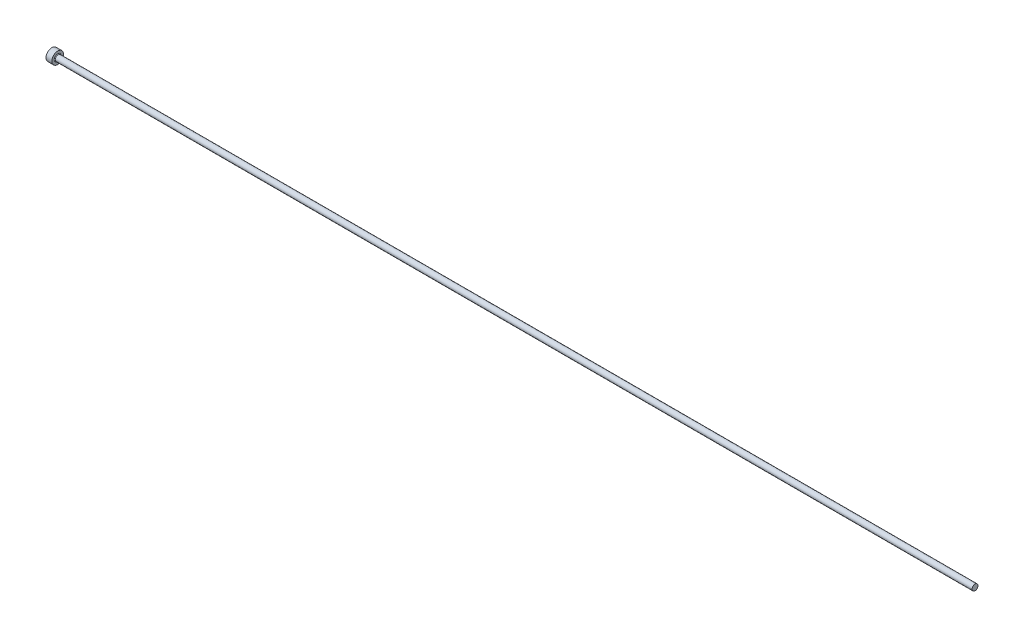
ISO-10303-21;
HEADER;
FILE_DESCRIPTION(('STEP AP214'),'2;1');
FILE_NAME('part.step','',(''),(''),'','','');
FILE_SCHEMA(('AUTOMOTIVE_DESIGN { 1 0 10303 214 1 1 1 1 }'));
ENDSEC;
DATA;
#1=APPLICATION_CONTEXT('core data for automotive mechanical design processes');
#2=APPLICATION_PROTOCOL_DEFINITION('international standard','automotive_design',2000,#1);
#3=PRODUCT_CONTEXT('',#1,'mechanical');
#4=PRODUCT('Part','Part','',(#3));
#5=PRODUCT_RELATED_PRODUCT_CATEGORY('part','',(#4));
#6=PRODUCT_DEFINITION_FORMATION('','',#4);
#7=PRODUCT_DEFINITION_CONTEXT('part definition',#1,'design');
#8=PRODUCT_DEFINITION('design','',#6,#7);
#9=PRODUCT_DEFINITION_SHAPE('','',#8);
#10=(LENGTH_UNIT() NAMED_UNIT(*) SI_UNIT(.MILLI.,.METRE.));
#11=(NAMED_UNIT(*) PLANE_ANGLE_UNIT() SI_UNIT($,.RADIAN.));
#12=(NAMED_UNIT(*) SI_UNIT($,.STERADIAN.) SOLID_ANGLE_UNIT());
#13=UNCERTAINTY_MEASURE_WITH_UNIT(LENGTH_MEASURE(1.E-05),#10,'distance_accuracy_value','');
#14=(GEOMETRIC_REPRESENTATION_CONTEXT(3) GLOBAL_UNCERTAINTY_ASSIGNED_CONTEXT((#13)) GLOBAL_UNIT_ASSIGNED_CONTEXT((#10,
#11,#12)) REPRESENTATION_CONTEXT('',''));
#15=CARTESIAN_POINT('',(0.,0.,0.));
#16=DIRECTION('',(0.,0.,1.));
#17=DIRECTION('',(1.,0.,0.));
#18=AXIS2_PLACEMENT_3D('',#15,#16,#17);
#19=CARTESIAN_POINT('',(0.,0.,0.));
#20=DIRECTION('',(-1.,0.,0.));
#21=DIRECTION('',(0.,-1.,0.));
#22=AXIS2_PLACEMENT_3D('',#19,#20,#21);
#23=PLANE('',#22);
#24=CARTESIAN_POINT('',(0.,0.,0.));
#25=DIRECTION('',(1.,0.,0.));
#26=DIRECTION('',(0.,1.,0.));
#27=AXIS2_PLACEMENT_3D('',#24,#25,#26);
#28=CIRCLE('',#27,2.);
#29=CARTESIAN_POINT('',(0.,2.,0.));
#30=VERTEX_POINT('',#29);
#31=EDGE_CURVE('E25',#30,#30,#28,.T.);
#32=ORIENTED_EDGE('',*,*,#31,.F.);
#33=EDGE_LOOP('',(#32));
#34=FACE_BOUND('',#33,.T.);
#35=ADVANCED_FACE('F14',(#34),#23,.T.);
#36=CARTESIAN_POINT('',(315.,0.,0.));
#37=DIRECTION('',(1.,0.,0.));
#38=DIRECTION('',(0.,1.,0.));
#39=AXIS2_PLACEMENT_3D('',#36,#37,#38);
#40=CYLINDRICAL_SURFACE('',#39,2.);
#41=ORIENTED_EDGE('',*,*,#31,.T.);
#42=EDGE_LOOP('',(#41));
#43=FACE_BOUND('',#42,.T.);
#44=CARTESIAN_POINT('',(2.,0.,0.));
#45=DIRECTION('',(1.,0.,0.));
#46=DIRECTION('',(0.,1.,0.));
#47=AXIS2_PLACEMENT_3D('',#44,#45,#46);
#48=CIRCLE('',#47,2.);
#49=CARTESIAN_POINT('',(2.,2.,0.));
#50=VERTEX_POINT('',#49);
#51=EDGE_CURVE('E29',#50,#50,#48,.T.);
#52=ORIENTED_EDGE('',*,*,#51,.F.);
#53=EDGE_LOOP('',(#52));
#54=FACE_BOUND('',#53,.T.);
#55=ADVANCED_FACE('F51',(#43,#54),#40,.T.);
#56=CARTESIAN_POINT('',(2.,2.,0.));
#57=DIRECTION('',(1.,0.,0.));
#58=DIRECTION('',(0.,1.,0.));
#59=AXIS2_PLACEMENT_3D('',#56,#57,#58);
#60=PLANE('',#59);
#61=CARTESIAN_POINT('',(2.,0.,0.));
#62=DIRECTION('',(1.,0.,0.));
#63=DIRECTION('',(0.,1.,0.));
#64=AXIS2_PLACEMENT_3D('',#61,#62,#63);
#65=CIRCLE('',#64,1.19999999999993);
#66=CARTESIAN_POINT('',(2.,1.19999999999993,0.));
#67=VERTEX_POINT('',#66);
#68=EDGE_CURVE('E9',#67,#67,#65,.F.);
#69=ORIENTED_EDGE('',*,*,#68,.T.);
#70=EDGE_LOOP('',(#69));
#71=FACE_BOUND('',#70,.T.);
#72=ORIENTED_EDGE('',*,*,#51,.T.);
#73=EDGE_LOOP('',(#72));
#74=FACE_BOUND('',#73,.T.);
#75=ADVANCED_FACE('F42',(#71,#74),#60,.T.);
#76=CARTESIAN_POINT('',(315.,0.,0.));
#77=DIRECTION('',(1.,0.,0.));
#78=DIRECTION('',(0.,1.,0.));
#79=AXIS2_PLACEMENT_3D('',#76,#77,#78);
#80=CYLINDRICAL_SURFACE('',#79,0.999999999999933);
#81=CARTESIAN_POINT('',(2.2,0.,0.));
#82=DIRECTION('',(1.,0.,0.));
#83=DIRECTION('',(0.,1.,0.));
#84=AXIS2_PLACEMENT_3D('',#81,#82,#83);
#85=CIRCLE('',#84,0.999999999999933);
#86=CARTESIAN_POINT('',(2.2,0.999999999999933,0.));
#87=VERTEX_POINT('',#86);
#88=EDGE_CURVE('E21',#87,#87,#85,.T.);
#89=ORIENTED_EDGE('',*,*,#88,.T.);
#90=EDGE_LOOP('',(#89));
#91=FACE_BOUND('',#90,.T.);
#92=CARTESIAN_POINT('',(315.,0.,0.));
#93=DIRECTION('',(1.,0.,0.));
#94=DIRECTION('',(0.,1.,0.));
#95=AXIS2_PLACEMENT_3D('',#92,#93,#94);
#96=CIRCLE('',#95,0.999999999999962);
#97=CARTESIAN_POINT('',(315.,0.99999999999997,0.));
#98=VERTEX_POINT('',#97);
#99=EDGE_CURVE('E34',#98,#98,#96,.T.);
#100=ORIENTED_EDGE('',*,*,#99,.F.);
#101=EDGE_LOOP('',(#100));
#102=FACE_BOUND('',#101,.T.);
#103=ADVANCED_FACE('F40',(#91,#102),#80,.T.);
#104=CARTESIAN_POINT('',(315.,0.99999999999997,0.));
#105=DIRECTION('',(1.,0.,0.));
#106=DIRECTION('',(0.,1.,0.));
#107=AXIS2_PLACEMENT_3D('',#104,#105,#106);
#108=PLANE('',#107);
#109=ORIENTED_EDGE('',*,*,#99,.T.);
#110=EDGE_LOOP('',(#109));
#111=FACE_BOUND('',#110,.T.);
#112=ADVANCED_FACE('F38',(#111),#108,.T.);
#113=CARTESIAN_POINT('',(2.2,0.,0.));
#114=DIRECTION('',(1.,0.,0.));
#115=DIRECTION('',(0.,1.,0.));
#116=AXIS2_PLACEMENT_3D('',#113,#114,#115);
#117=TOROIDAL_SURFACE('',#116,1.19999999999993,0.2);
#118=ORIENTED_EDGE('',*,*,#68,.F.);
#119=EDGE_LOOP('',(#118));
#120=FACE_BOUND('',#119,.T.);
#121=ORIENTED_EDGE('',*,*,#88,.F.);
#122=EDGE_LOOP('',(#121));
#123=FACE_BOUND('',#122,.T.);
#124=ADVANCED_FACE('F16',(#120,#123),#117,.F.);
#125=CLOSED_SHELL('',(#35,#55,#75,#103,#112,#124));
#126=MANIFOLD_SOLID_BREP('B1',#125);
#127=ADVANCED_BREP_SHAPE_REPRESENTATION('',(#18,#126),#14);
#128=SHAPE_DEFINITION_REPRESENTATION(#9,#127);
ENDSEC;
END-ISO-10303-21;
